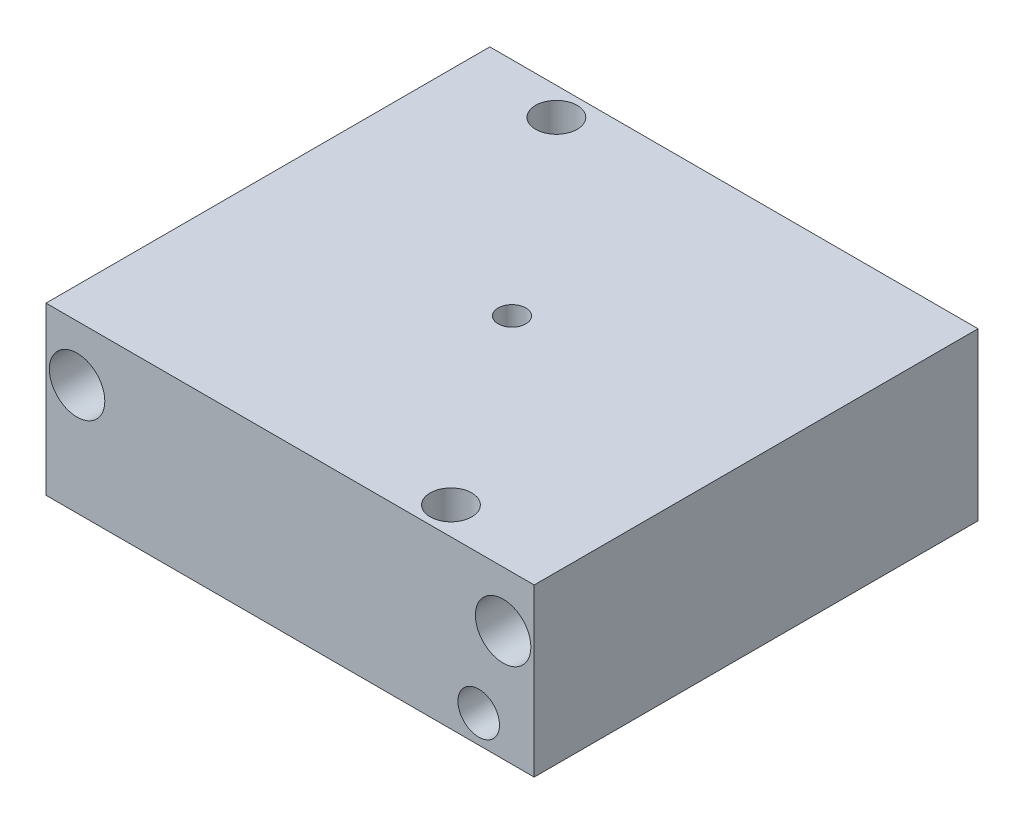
from build123d import *

# Parameters (mm, degrees)
SKETCH1_W          = 111.76
SKETCH1_H          = 101.6
EXTRUDE1_DEPTH     = 38.1
SKETCH3_R          = 4.7625
CUT_EXTRUDE2_DEPTH = 124.484609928
SKETCH5_R          = 6.35
CUT_EXTRUDE3_DEPTH = 190.5
SKETCH6_R          = 4.7625
CUT_EXTRUDE4_DEPTH = 99.584697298
SKETCH7_R          = 3.175
CUT_EXTRUDE5_DEPTH = 99.584697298


with BuildPart() as part:
    # Sketch1 → Extrude1 (new body)
    with BuildSketch(Plane(origin=(0, 0, 0), x_dir=(1, 0, 0), z_dir=(0, 1, 0))):
        with Locations((-3.063013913, 18.431883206)):
            Rectangle(SKETCH1_W, SKETCH1_H)
    extrude(amount=EXTRUDE1_DEPTH)

    # Sketch3 → Cut-Extrude2 (cut, through all)
    with BuildSketch(Plane.XY.offset(32.368116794)):
        with Locations((40.116986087, 6.35)):
            Circle(SKETCH3_R)
    extrude(amount=-CUT_EXTRUDE2_DEPTH, mode=Mode.SUBTRACT)

    # Sketch5 → Cut-Extrude3 (cut)
    with BuildSketch(Plane.XY.offset(32.368116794)):
        with Locations((45.704986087, 25.4)):
            Circle(SKETCH5_R)
        with Locations((-51.831013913, 25.4)):
            Circle(SKETCH5_R)
    extrude(amount=-CUT_EXTRUDE3_DEPTH, mode=Mode.SUBTRACT)

    # Sketch6 → Cut-Extrude4 (cut, through all)
    with BuildSketch(Plane(origin=(0, 38.1, 0), x_dir=(-1, 0, 0), z_dir=(0, 1, 0))):
        with Locations(Location((-27.416986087, 26.018116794, 0), (0, 0, 90))):
            Circle(SKETCH6_R)
        with Locations(Location((37.353013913, -62.881883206, 0), (0, 0, 90))):
            Circle(SKETCH6_R)
    extrude(amount=-CUT_EXTRUDE4_DEPTH, mode=Mode.SUBTRACT)

    # Sketch7 → Cut-Extrude5 (cut, through all)
    with BuildSketch(Plane(origin=(0, 38.1, 0), x_dir=(-1, 0, 0), z_dir=(0, 1, 0))):
        with Locations(Location((3.063013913, -18.431883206, 0), (0, 0, 90))):
            Circle(SKETCH7_R)
    extrude(amount=-CUT_EXTRUDE5_DEPTH, mode=Mode.SUBTRACT)


solid = part.part
